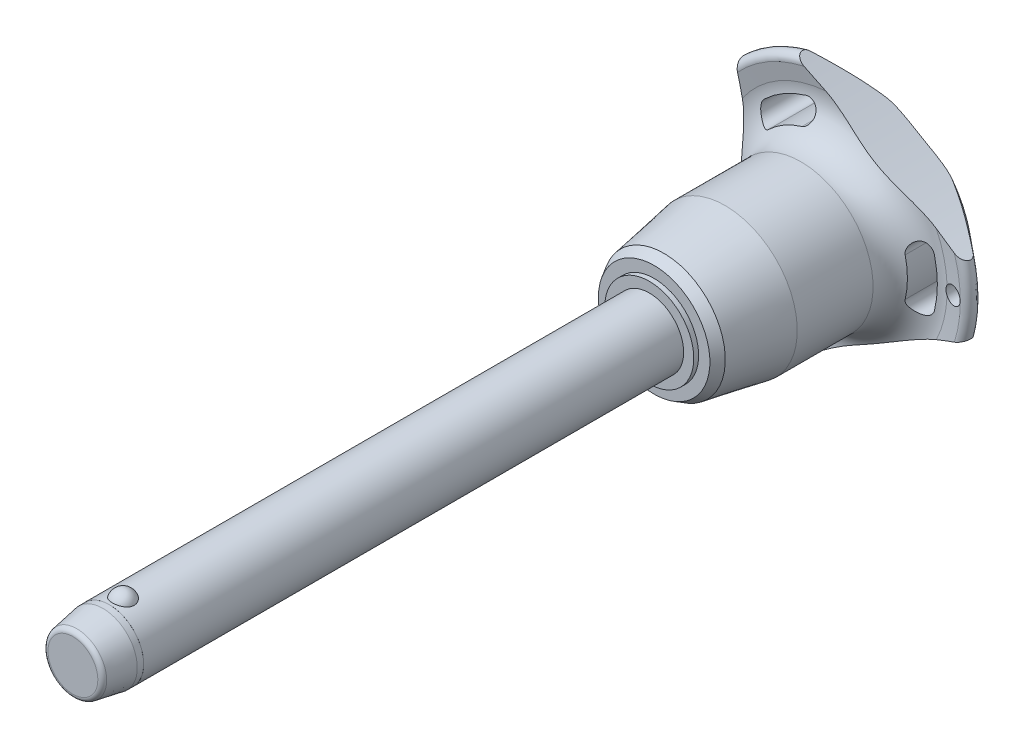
from build123d import *

# Parameters (mm, degrees)
SKETCH1_R           = 6
BOSS_EXTRUDE1_DEPTH = 90
SKETCH2_R           = 5.15
BOSS_EXTRUDE2_DEPTH = 39.7
BOSS_EXTRUDE3_START = 10.6
SKETCH1_2_R         = 6
BOSS_EXTRUDE3_DEPTH = 10.6
CHAMFER1_SIZE       = 5.3
CHAMFER1_SIZE2      = 0.934532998
FILLET1_R           = 0.85
SKETCH6_R           = 144.275
CUT_EXTRUDE1_DEPTH  = 134.999042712
CIRPATTERN1_COUNT   = 3
SKETCH7_R           = 1.5
CUT_EXTRUDE2_DEPTH  = 134.849189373
SKETCH8_R           = 6
SKETCH8_R_2         = 5.99
CUT_EXTRUDE3_DEPTH  = 6.36


with BuildPart() as part:
    # Sketch1 → Boss-Extrude1 (new body)
    with BuildSketch(Plane.XY):
        Circle(SKETCH1_R)
    extrude(amount=-BOSS_EXTRUDE1_DEPTH)

    # Sketch2 → Boss-Extrude2 (add)
    with BuildSketch(Plane(origin=(0, 0, -90), x_dir=(-1, 0, 0), z_dir=(0, 0, -1))):
        Circle(SKETCH2_R)
    extrude(amount=BOSS_EXTRUDE2_DEPTH)

    # Sketch3 → Revolve1 (revolve)
    with BuildSketch(Plane(origin=(0, 0, 0), x_dir=(0, 0, -1), z_dir=(1, 0, 0))):
        with BuildLine():
            Line((-1.854049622, 7.25), (-1.854049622, 3.25))
            ThreePointArc((-1.854049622, 3.25), (0.145950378, 5.25), (-1.854049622, 7.25))
        make_face()
        with BuildLine():
            Line((-1.854049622, -3.25), (-1.854049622, -7.25))
            ThreePointArc((-1.854049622, -7.25), (0.145950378, -5.25), (-1.854049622, -3.25))
        make_face()
    revolve(axis=Axis((0, -3.25, 1.854049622), (0, 1, 0)))

    # Sketch1_2 → Boss-Extrude3 (add)
    with BuildSketch(Plane.XY.offset(BOSS_EXTRUDE3_START)):
        Circle(SKETCH1_2_R)
    extrude(amount=-BOSS_EXTRUDE3_DEPTH)

    # Chamfer1
    chamfer1_edges = [part.edges().sort_by_distance(p)[0] for p in [
        (-6, 0, 10.6),
    ]]
    chamfer1_side = [part.faces().sort_by_distance(p)[0] for p in [
        (-6, 0, -39.7),
    ]]
    chamfer(chamfer1_edges, length=CHAMFER1_SIZE, length2=CHAMFER1_SIZE2, reference=chamfer1_side[0])

    # Fillet1
    fillet1_edges = [part.edges().sort_by_distance(p)[0] for p in [
        (-5.065467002, 0, 10.6),
        (5.15, 0, -129.7),
    ]]
    fillet(fillet1_edges, radius=FILLET1_R)

    # Sketch4 → Revolve2 (revolve)
    with BuildSketch(Plane(origin=(0, 0, 0), x_dir=(0, 0, -1), z_dir=(1, 0, 0)), mode=Mode.PRIVATE) as revolve2_sk:
        Polygon((90, 0), (90, 7.770471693), (90.85, 7.770471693), (90.85, 9.734414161), (92.550824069, 10.716385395), (103.233333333, 12.6), (116.466666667, 12.6), (116.466666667, 0), align=None)
    revolve(revolve2_sk.sketch.rotate(Axis((0, 0, -116.466666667), (0, 0, 1)), 90), axis=Axis((0, 0, -116.466666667), (0, 0, 1)))

    # Sketch5 → Revolve3 (revolve)
    with BuildSketch(Plane(origin=(0, 0, 0), x_dir=(0, 0, -1), z_dir=(1, 0, 0)), mode=Mode.PRIVATE) as revolve3_sk:
        with BuildLine():
            Line((122.379459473, 19.619255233), (121.900774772, 22.396148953))
            ThreePointArc((121.900774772, 22.396148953), (122.578274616, 23.688538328), (124.002586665, 23.371345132))
            Line((124.002586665, 23.371345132), (129.141488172, 17.247040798))
            ThreePointArc((129.141488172, 17.247040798), (129.7, 15.584758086), (128.978803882, 13.986322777))
            ThreePointArc((128.978803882, 13.986322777), (124.617427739, 7.589034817), (123.083333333, 0))
            Line((123.083333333, 0), (116.466666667, 0))
            Line((116.466666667, 0), (116.466666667, 12.6))
            ThreePointArc((116.466666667, 12.6), (121.055540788, 14.734481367), (122.379459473, 19.619255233))
        make_face()
    revolve(revolve3_sk.sketch.rotate(Axis((0, 0, -123.083333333), (0, 0, 1)), 90), axis=Axis((0, 0, -123.083333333), (0, 0, 1)))

    # Sketch6 → Cut-Extrude1 (cut, through all)
    with BuildSketch(Plane.XY):
        with Locations((-159.975, 0)):
            Circle(SKETCH6_R)
        with BuildLine():
            ThreePointArc((17.365443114, -4.192809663), (17.864441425, 0), (17.365443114, 4.192809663))
            ThreePointArc((17.365443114, 4.192809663), (15.247788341, 5.486749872), (13.953848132, 3.369095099))
            ThreePointArc((13.953848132, 3.369095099), (14.354813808, 0), (13.953848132, -3.369095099))
            ThreePointArc((13.953848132, -3.369095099), (15.247788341, -5.486749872), (17.365443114, -4.192809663))
        make_face()
    cut_extrude1 = extrude(amount=-CUT_EXTRUDE1_DEPTH, mode=Mode.SUBTRACT)

    # CirPattern1: Cut-Extrude1 ×3 about axis
    cirpattern1_axis = Axis((0, 0, 0), (0, 0, 1))
    for i in range(1, CIRPATTERN1_COUNT):
        add(cut_extrude1.rotate(cirpattern1_axis, i * 360 / CIRPATTERN1_COUNT), mode=Mode.SUBTRACT)

    # Sketch7 → Cut-Extrude2 (cut, through all)
    with BuildSketch(Plane.XY):
        with Locations(Location((20.864441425, 0, 0), (0, 0, 221.008319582))):
            Circle(SKETCH7_R)
    extrude(amount=-CUT_EXTRUDE2_DEPTH, mode=Mode.SUBTRACT)

    # Sketch8 → Cut-Extrude3 (cut)
    with BuildSketch(Plane.XY.offset(10.6)):
        Circle(SKETCH8_R)
        Circle(SKETCH8_R_2, mode=Mode.SUBTRACT)
    extrude(amount=-CUT_EXTRUDE3_DEPTH, mode=Mode.SUBTRACT)


solid = part.part
